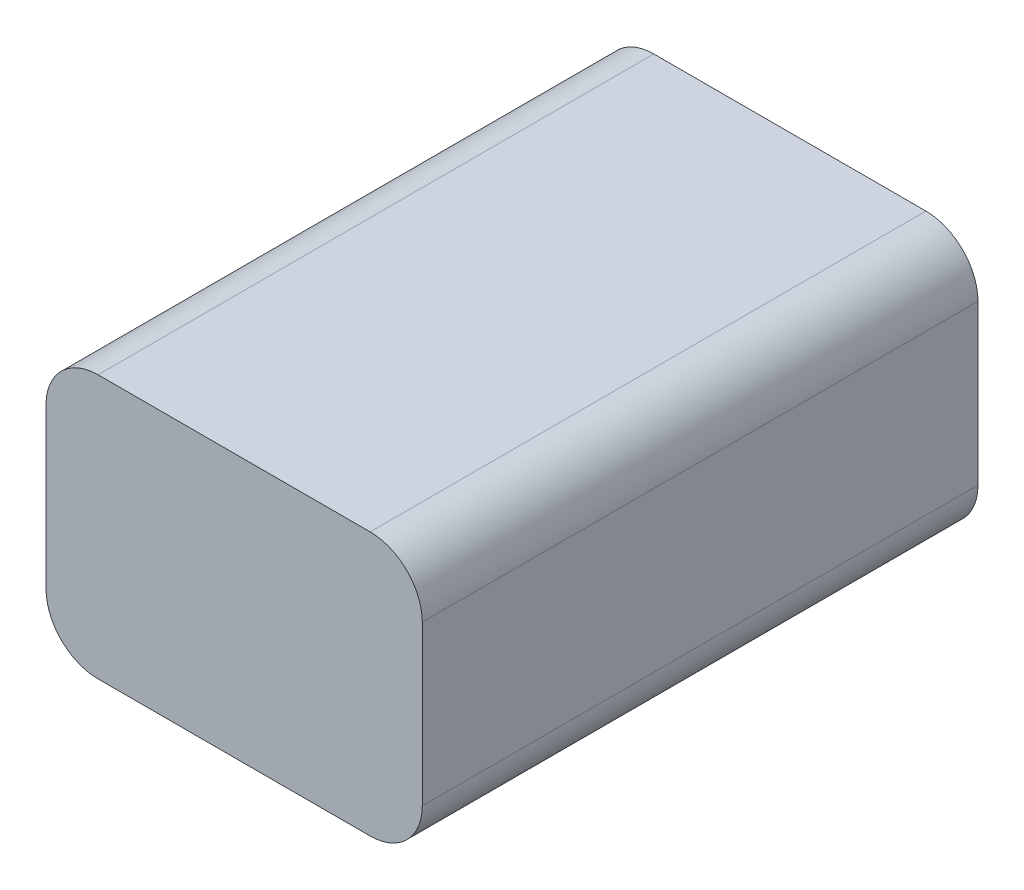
from build123d import *

# Parameters (mm, degrees)
SKETCH1_W      = 32.5
SKETCH1_H      = 22.75
EXTRUDE1_DEPTH = 24
FILLET1_R      = 4.5


with BuildPart() as part:
    # Sketch1 → Extrude1 (new, symmetric)
    with BuildSketch(Plane.XY):
        Rectangle(SKETCH1_W, SKETCH1_H)
    extrude(amount=EXTRUDE1_DEPTH, both=True)

    # Fillet1
    fillet1_edges = [part.edges().sort_by_distance(p)[0] for p in [
        (-16.25, 11.375, 0),
        (16.25, 11.375, 0),
        (16.25, -11.375, 0),
        (-16.25, -11.375, 0),
    ]]
    fillet(fillet1_edges, radius=FILLET1_R)


solid = part.part
